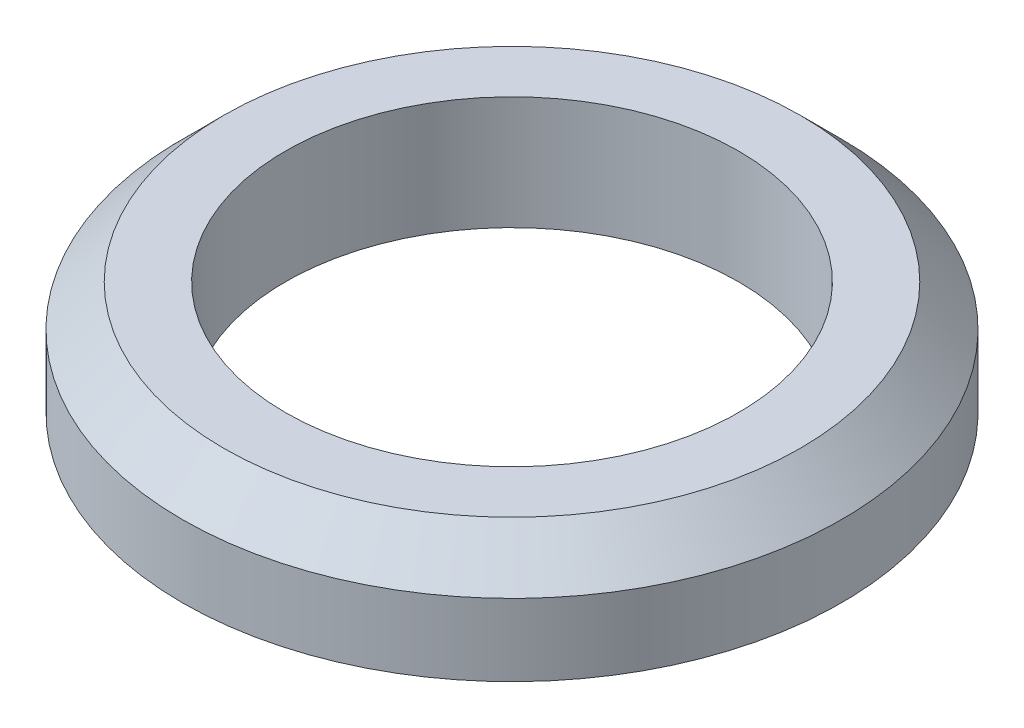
from build123d import *

# Parameters (mm, degrees)
ESQUISSE1_R          = 8
ESQUISSE1_R_2        = 5.5
BASE_EXTRUSION_DEPTH = 1.375
CHANFREIN1_SIZE      = 1


with BuildPart() as part:
    # Esquisse1 → Base-Extrusion (new, symmetric)
    with BuildSketch(Plane(origin=(0, 0, 0), x_dir=(1, 0, 0), z_dir=(0, 1, 0))):
        with Locations(Location((0, 0, 0), (0, 0, 270))):
            Circle(ESQUISSE1_R)
        with Locations(Location((0, 0, 0), (0, 0, 270))):
            Circle(ESQUISSE1_R_2, mode=Mode.SUBTRACT)
    extrude(amount=BASE_EXTRUSION_DEPTH, both=True)

    # Chanfrein1
    chanfrein1_edges = [part.edges().sort_by_distance(p)[0] for p in [
        (0, 1.375, -8),
    ]]
    chamfer(chanfrein1_edges, length=CHANFREIN1_SIZE)


solid = part.part
